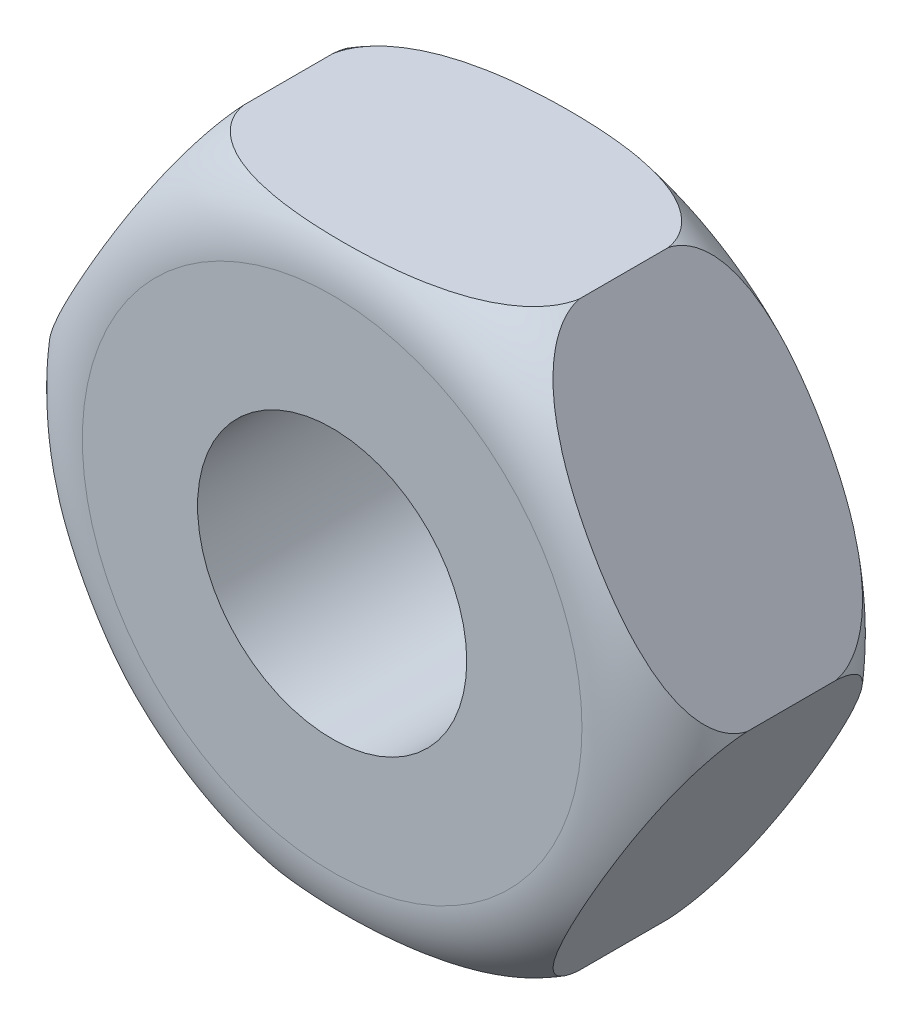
from build123d import *

# Parameters (mm, degrees)
ESQUISSE1_R             = 3.12
ESQUISSE1_R_2           = 1.25
EXTRUSION1_DEPTH        = 2.3
CONG_1_R                = 0.8
ESQUISSE2_OUTSIDE_W     = 10.064
ESQUISSE2_OUTSIDE_H     = 10.064
ENL_V_MAT_EXTRU_2_DEPTH = 6


with BuildPart() as part:
    # Esquisse1 → Extrusion1 (new body)
    with BuildSketch(Plane.XY):
        Circle(ESQUISSE1_R)
        Circle(ESQUISSE1_R_2, mode=Mode.SUBTRACT)
    extrude(amount=EXTRUSION1_DEPTH)

    # Cong_1
    cong_1_edges = [part.edges().sort_by_distance(p)[0] for p in [
        (-3.12, 0, 0),
        (-3.12, 0, 2.3),
    ]]
    fillet(cong_1_edges, radius=CONG_1_R)

    # Esquisse2 outside → Enl_v. mat.-Extru.2 (cut)
    with BuildSketch(Plane.XY):
        Rectangle(ESQUISSE2_OUTSIDE_W, ESQUISSE2_OUTSIDE_H)
        Polygon((3.117691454, 0), (1.558845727, 2.7), (-1.558845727, 2.7), (-3.117691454, 0), (-1.558845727, -2.7), (1.558845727, -2.7), align=None, mode=Mode.SUBTRACT)
    extrude(amount=ENL_V_MAT_EXTRU_2_DEPTH, mode=Mode.SUBTRACT)


solid = part.part
